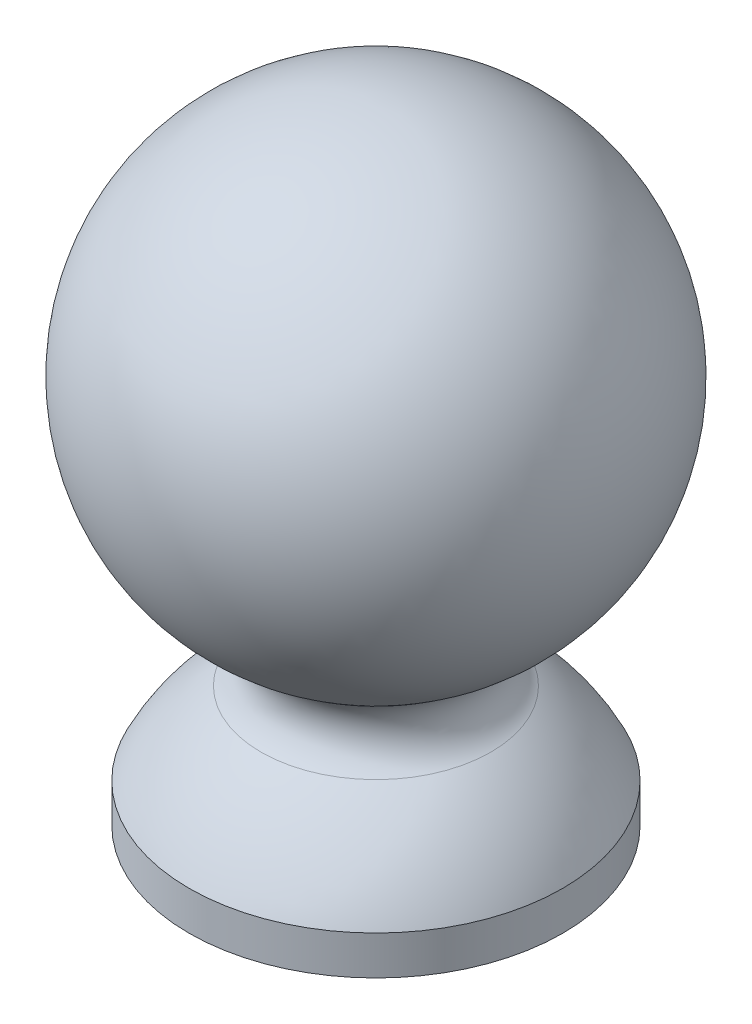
from build123d import *

# Parameters (mm, degrees)
SKETCH4_R           = 24
BOSS_EXTRUDE1_DEPTH = 5
SKETCH5_R           = 12
CUT_EXTRUDE2_DEPTH  = 3.5
SKETCH6_R           = 2.75
CUT_EXTRUDE3_DEPTH  = 5.5


with BuildPart() as part:
    # Sketch1 → Revolve1 (revolve)
    with BuildSketch(Plane.XY, mode=Mode.PRIVATE) as revolve1_sk:
        with BuildLine():
            Line((0, 30), (0, -30))
            Line((0, -30), (0, -45))
            Line((0, -45), (-24, -45))
            ThreePointArc((-24, -45), (-20.088427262, -39.111791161), (-14.768717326, -34.45646187))
            ThreePointArc((-14.768717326, -34.45646187), (-12.53674995, -30.137556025), (-15.029481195, -25.963718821))
            ThreePointArc((-15.029481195, -25.963718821), (-28.973363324, 7.781016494), (0, 30))
        make_face()
    revolve(revolve1_sk.sketch.rotate(Axis((0, 30, 0), (0, -1, 0)), 270), axis=Axis((0, 30, 0), (0, -1, 0)))

    # Sketch4 → Boss-Extrude1 (add)
    with BuildSketch(Plane.XZ.offset(45)):
        with Locations(Location((0, 0, 0), (0, 0, 180))):
            Circle(SKETCH4_R)
    extrude(amount=BOSS_EXTRUDE1_DEPTH)

    # Sketch5 → Cut-Extrude2 (cut)
    with BuildSketch(Plane.XZ.offset(50)):
        with Locations(Location((0, 0, 0), (0, 0, 270))):
            Circle(SKETCH5_R)
    extrude(amount=-CUT_EXTRUDE2_DEPTH, mode=Mode.SUBTRACT)

    # Sketch6 → Cut-Extrude3 (cut)
    with BuildSketch(Plane.XZ.offset(50)):
        with Locations(Location((-19, 0, 0), (0, 0, 270))):
            Circle(SKETCH6_R)
        with Locations(Location((0, 19, 0), (0, 0, 270))):
            Circle(SKETCH6_R)
        with Locations(Location((19, 0, 0), (0, 0, 270))):
            Circle(SKETCH6_R)
        with Locations(Location((0, -19, 0), (0, 0, 270))):
            Circle(SKETCH6_R)
    extrude(amount=-CUT_EXTRUDE3_DEPTH, mode=Mode.SUBTRACT)


solid = part.part
